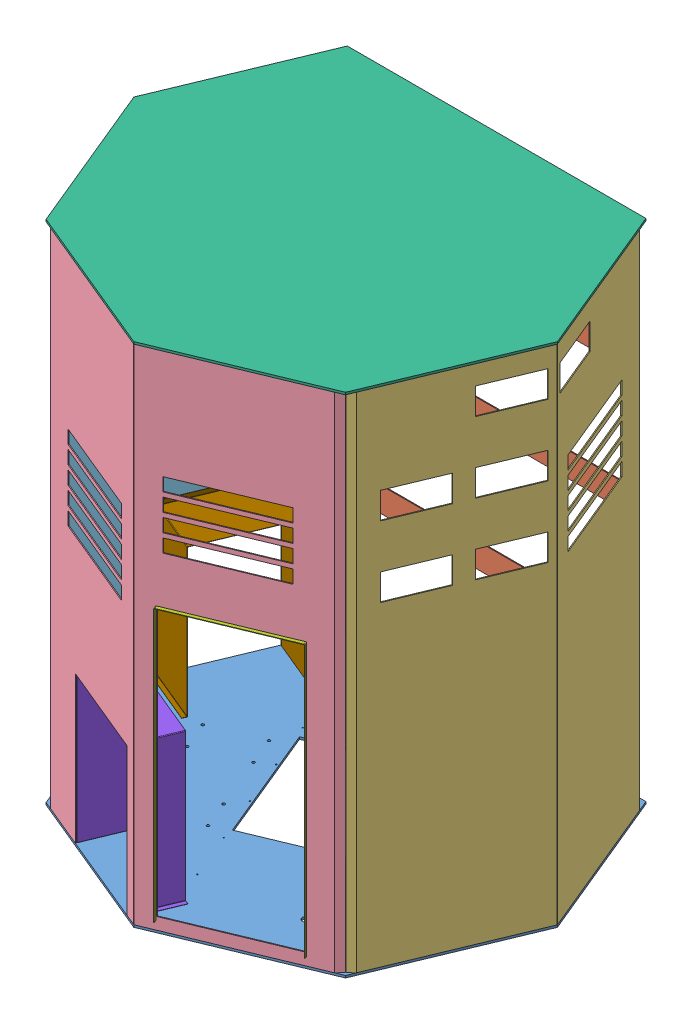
SolidWorks assembly STRUCTURE METALLIQUE EOL.SLDASM, configuration Défaut (file format 8000). Lengths in mm.
Overall size (2300.63 2296 1834.95).
9 component instances, 9 part files, 24 mates.
Components (placement in the parent):
- Plancher Plateforme EOL-1: Plancher Plateforme EOL.SLDPRT [Défaut] at (-31.6013 -2194.383 79.0375) size (1917.44 10 1642)
- Flanc Sud EOL-1: Flanc Sud EOL.SLDPRT [Défaut] at (614.2141 -2184.383 -600.2411) x (-1 0 0) z (0 0 -1) size (1339.5 2276 49.5)
- Flanc Ouest EOL-1: Flanc Ouest EOL.SLDPRT [Défaut] at (665.1659 -2184.383 -553.6175) x (-0.382415 0 -0.923991) z (0.923991 0 -0.382415) size (1221.77 2276 538.13)
- Flanc Nord EOL-1: Flanc Nord EOL.SLDPRT [Défaut] at (610.2936 -2184.383 771.9806) x (0.923991 0 -0.382415) z (0.382415 0 0.923991) size (1231.77 2276 538.13)
- Flanc Est EOL-1: Flanc Est EOL.SLDPRT [Défaut] at (-724.5443 -2184.383 720.9325) x (0.382415 0 0.923991) z (-0.923991 0 0.382415) size (1224.7 2276 531.05)
- Toiture EOL-1: Toiture EOL.SLDPRT [Défaut] at (-31.6013 91.617 79.0375) size (1917.44 10 1642)
- Bavette pour porte principale-1: Bavette pour porte principale.SLDPRT [Défaut] at (519.7426 -2145.383 809.4572) x (0.923991 0 -0.382415) z (0.382415 0 0.923991) size (524 1232 15)
- Boite Bloc PC-1: Boite Bloc PC.SLDPRT [Défaut] at (-283.4606 -1517.383 929.135) x (-0.923768 0 -0.382952) z (0.382952 0 -0.923768) size (468 686 200)
- Boite Bloc Batterie-1: Boite Bloc Batterie.SLDPRT [Défaut] at (-873.9564 -1517.383 -191.4982) x (0.382952 0 -0.923768) z (0.923768 0 0.382952) size (468 686 250)
Mates (geometry in assembly coordinates):
- Coïncidente685: coincident aligned: plane of Plancher Plateforme EOL-1 through (646.1201 -2184.383 757.1529) normal (0.923768 0 0.382952); plane of Flanc Ouest EOL-1 through (927.1201 91.617 79.3161) normal (0.923768 0 0.382952)
- Coïncidente686: coincident anti-aligned: plane of Plancher Plateforme EOL-1 through (-1189.0197 -2184.383 558.0619) normal (0 1 0); plane of Flanc Ouest EOL-1 through (612.2248 -2184.383 715.9456) normal (0 -1 0)
- Coïncidente687: coincident aligned: plane of Plancher Plateforme EOL-1 through (927.1201 -2184.383 79.3161) normal (0.923991 0 -0.382415); plane of Flanc Ouest EOL-1 through (665.1659 91.617 -553.6175) normal (0.923991 0 -0.382415)
- Coïncidente689: coincident anti-aligned: plane of Plancher Plateforme EOL-1 through (-1189.0197 -2184.383 558.0619) normal (0 1 0); plane of Flanc Est EOL-1 through (-679.2569 -2184.383 -548.6328) normal (0 -1 0)
- Coïncidente690: coincident aligned: plane of Plancher Plateforme EOL-1 through (-707.1823 -2184.383 -604.2411) normal (-0.923768 0 -0.382952); plane of Flanc Est EOL-1 through (-990.3227 91.617 78.7589) normal (-0.923768 0 -0.382952)
- Coïncidente691: coincident aligned: plane of Plancher Plateforme EOL-1 through (-990.3227 -2184.383 78.7589) normal (-0.923991 0 0.382415); plane of Flanc Est EOL-1 through (-724.5443 91.617 720.9325) normal (-0.923991 0 0.382415)
- Coïncidente692: coincident anti-aligned: plane of Plancher Plateforme EOL-1 through (-1189.0197 -2184.383 558.0619) normal (0 1 0); plane of Flanc Nord EOL-1 through (-668.5094 -2184.383 722.8636) normal (0 -1 0)
- Coïncidente693: coincident aligned: plane of Plancher Plateforme EOL-1 through (-709.7167 -2184.383 756.7589) normal (-0.382952 0 0.923768); plane of Flanc Nord EOL-1 through (-31.8799 91.617 1037.7589) normal (-0.382952 0 0.923768)
- Coïncidente699: coincident aligned: plane of Plancher Plateforme EOL-1 through (-707.1823 -2184.383 -604.2411) normal (0 0 -1); plane of Flanc Sud EOL-1 through (614.2141 91.617 -604.2411) normal (0 0 -1)
- Coïncidente700: coincident anti-aligned: plane of Plancher Plateforme EOL-1 through (-1189.0197 -2184.383 558.0619) normal (0 1 0); plane of Flanc Sud EOL-1 through (614.2141 -2184.383 -604.2411) normal (0 -1 0)
- Distance1: distance = 30 mm: line of Flanc Sud EOL-1 through (614.2141 91.617 -604.2411) axis (0 -1 0); line of Plancher Plateforme EOL-1 through (644.2141 -2184.383 -604.2411) axis (0 -1 0)
- Coïncidente703: coincident aligned: plane of Plancher Plateforme EOL-1 through (-31.8799 -2184.383 1037.7589) normal (0.382415 0 0.923991); plane of Flanc Nord EOL-1 through (610.2936 91.617 771.9806) normal (0.382415 0 0.923991)
- Coïncidente704: coincident anti-aligned: plane of Flanc Est EOL-1 through (-679.2569 91.617 -548.6328) normal (0 1 0); plane of Toiture EOL-1 through (-1189.0197 91.617 558.0619) normal (0 -1 0)
- Coïncidente705: coincident aligned: plane of Plancher Plateforme EOL-1 through (-707.1823 -2184.383 -604.2411) normal (0 0 -1); plane of Toiture EOL-1 through (-707.1823 101.617 -604.2411) normal (0 0 -1)
- Coïncidente707: coincident aligned: plane of Plancher Plateforme EOL-1 through (-707.1823 -2184.383 -604.2411) normal (-0.923768 0 -0.382952); plane of Toiture EOL-1 through (-707.1823 101.617 -604.2411) normal (-0.923768 0 -0.382952)
- Coïncidente711: coincident anti-aligned: plane of Flanc Nord EOL-1 through (610.2936 91.617 771.9806) normal (0.382415 0 0.923991); plane of Bavette pour porte principale-1 through (517.8946 -917.383 810.222) normal (-0.382415 0 -0.923991)
- Distance2: distance = 5 mm aligned: plane of Bavette pour porte principale-1 through (46.8516 -915.383 1021.408) normal (0 -1 0); plane of Flanc Nord EOL-1 through (-162.824 -920.383 509.5602) normal (0 -1 0)
- Distance3: distance = 4 mm aligned: plane of Bavette pour porte principale-1 through (45.0036 -917.383 1022.1728) normal (0.923991 0 -0.382415); plane of Flanc Nord EOL-1 through (-162.824 -920.383 509.5602) normal (0.923991 0 -0.382415)
- Coïncidente721: coincident anti-aligned: plane of Flanc Nord EOL-1 through (-30.3481 91.617 1034.0639) normal (0.382952 0 -0.923768); plane of Boite Bloc PC-1 through (-283.4606 -1517.383 929.135) normal (-0.382952 0 0.923768)
- Coïncidente722: coincident anti-aligned: plane of Plancher Plateforme EOL-1 through (-1189.0197 -2184.383 558.0619) normal (0 1 0); plane of Boite Bloc PC-1 through (-283.4606 -2184.383 929.135) normal (0 -1 0)
- Coïncidente723: coincident aligned: plane of Flanc Nord EOL-1 through (-140.0392 -2184.383 24.3526) normal (0.923768 0 0.382952); plane of Boite Bloc PC-1 through (-404.5566 -1520.383 662.4297) normal (0.923768 0 0.382952)
- Coïncidente724: coincident anti-aligned: plane of Plancher Plateforme EOL-1 through (-1189.0197 -2184.383 558.0619) normal (0 1 0); plane of Boite Bloc Batterie-1 through (-873.9564 -2184.383 -191.4982) normal (0 -1 0)
- Coïncidente725: coincident anti-aligned: plane of Flanc Est EOL-1 through (-986.6276 91.617 80.2907) normal (0.923768 0 0.382952); plane of Boite Bloc Batterie-1 through (-873.9564 -1517.383 -191.4982) normal (-0.923768 0 -0.382952)
- Coïncidente726: coincident: line of Flanc Est EOL-1 through (-959.6032 -2184.383 4.6564) axis (0 1 0); plane of Boite Bloc Batterie-1 through (-724.966 -2184.383 101.9262) normal (0.382952 0 -0.923768)
